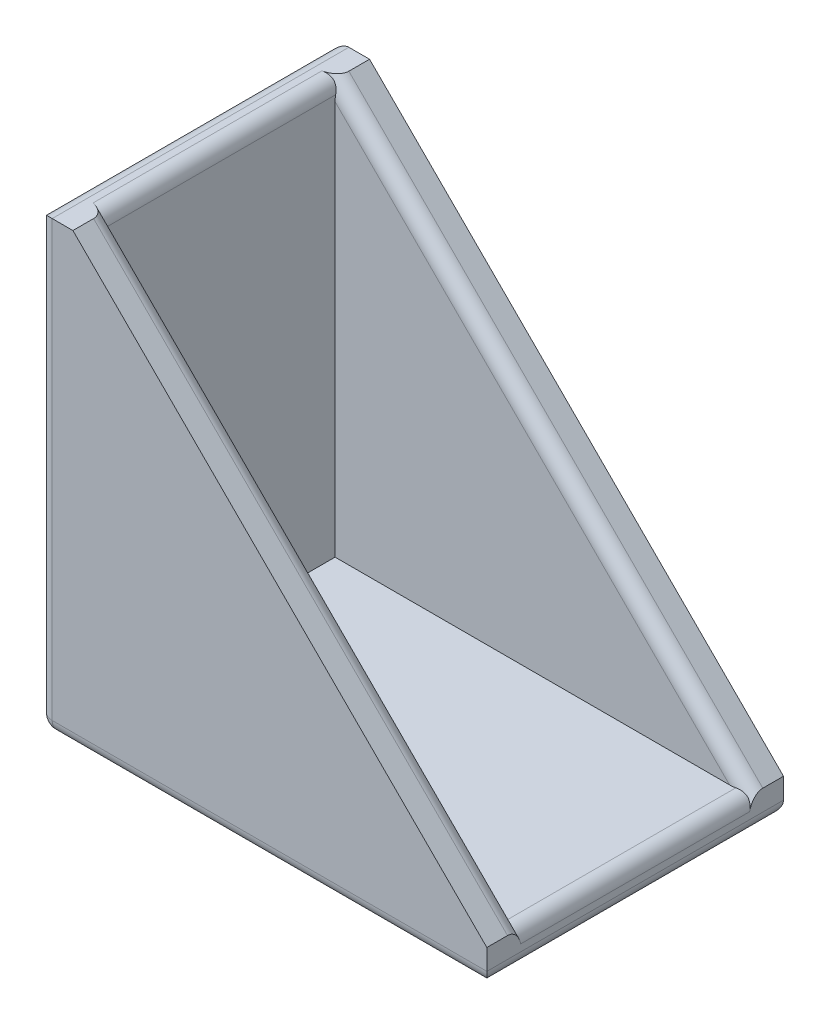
ISO-10303-21;
HEADER;
FILE_DESCRIPTION(('STEP AP214'),'2;1');
FILE_NAME('part.step','',(''),(''),'','','');
FILE_SCHEMA(('AUTOMOTIVE_DESIGN { 1 0 10303 214 1 1 1 1 }'));
ENDSEC;
DATA;
#1=APPLICATION_CONTEXT('core data for automotive mechanical design processes');
#2=APPLICATION_PROTOCOL_DEFINITION('international standard','automotive_design',2000,#1);
#3=PRODUCT_CONTEXT('',#1,'mechanical');
#4=PRODUCT('Part','Part','',(#3));
#5=PRODUCT_RELATED_PRODUCT_CATEGORY('part','',(#4));
#6=PRODUCT_DEFINITION_FORMATION('','',#4);
#7=PRODUCT_DEFINITION_CONTEXT('part definition',#1,'design');
#8=PRODUCT_DEFINITION('design','',#6,#7);
#9=PRODUCT_DEFINITION_SHAPE('','',#8);
#10=(LENGTH_UNIT() NAMED_UNIT(*) SI_UNIT(.MILLI.,.METRE.));
#11=(NAMED_UNIT(*) PLANE_ANGLE_UNIT() SI_UNIT($,.RADIAN.));
#12=(NAMED_UNIT(*) SI_UNIT($,.STERADIAN.) SOLID_ANGLE_UNIT());
#13=UNCERTAINTY_MEASURE_WITH_UNIT(LENGTH_MEASURE(1.E-05),#10,'distance_accuracy_value','');
#14=(GEOMETRIC_REPRESENTATION_CONTEXT(3) GLOBAL_UNCERTAINTY_ASSIGNED_CONTEXT((#13)) GLOBAL_UNIT_ASSIGNED_CONTEXT((#10,
#11,#12)) REPRESENTATION_CONTEXT('',''));
#15=CARTESIAN_POINT('',(0.,0.,0.));
#16=DIRECTION('',(0.,0.,1.));
#17=DIRECTION('',(1.,0.,0.));
#18=AXIS2_PLACEMENT_3D('',#15,#16,#17);
#19=CARTESIAN_POINT('',(15.,17.5,0.));
#20=DIRECTION('',(-1.,0.,0.));
#21=DIRECTION('',(0.,0.,1.));
#22=AXIS2_PLACEMENT_3D('',#19,#20,#21);
#23=PLANE('',#22);
#24=CARTESIAN_POINT('',(15.,-16.4142135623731,-9.25));
#25=DIRECTION('',(-1.,0.,0.));
#26=DIRECTION('',(0.,1.,0.));
#27=AXIS2_PLACEMENT_3D('',#24,#25,#26);
#28=ELLIPSE('',#27,1.41421356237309,1.);
#29=CARTESIAN_POINT('',(15.,-15.,-9.25));
#30=VERTEX_POINT('',#29);
#31=CARTESIAN_POINT('',(15.,-16.,-8.29385484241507));
#32=VERTEX_POINT('',#31);
#33=EDGE_CURVE('E322',#30,#32,#28,.F.);
#34=ORIENTED_EDGE('',*,*,#33,.T.);
#35=DIRECTION('',(0.,0.,1.));
#36=VECTOR('',#35,1.);
#37=CARTESIAN_POINT('',(15.,-16.,8.25));
#38=LINE('',#37,#36);
#39=CARTESIAN_POINT('',(15.,-16.,8.29385484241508));
#40=VERTEX_POINT('',#39);
#41=EDGE_CURVE('E258',#32,#40,#38,.T.);
#42=ORIENTED_EDGE('',*,*,#41,.T.);
#43=CARTESIAN_POINT('',(15.,-16.4142135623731,9.25));
#44=DIRECTION('',(-1.,0.,0.));
#45=DIRECTION('',(0.,-1.,0.));
#46=AXIS2_PLACEMENT_3D('',#43,#44,#45);
#47=ELLIPSE('',#46,1.41421356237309,1.);
#48=CARTESIAN_POINT('',(15.,-15.,9.25));
#49=VERTEX_POINT('',#48);
#50=EDGE_CURVE('E319',#40,#49,#47,.F.);
#51=ORIENTED_EDGE('',*,*,#50,.T.);
#52=DIRECTION('',(0.,0.,1.));
#53=VECTOR('',#52,1.);
#54=CARTESIAN_POINT('',(15.,-15.,-10.75));
#55=LINE('',#54,#53);
#56=CARTESIAN_POINT('',(15.,-15.,10.75));
#57=VERTEX_POINT('',#56);
#58=EDGE_CURVE('E186',#49,#57,#55,.T.);
#59=ORIENTED_EDGE('',*,*,#58,.T.);
#60=DIRECTION('',(0.,-1.,0.));
#61=VECTOR('',#60,1.);
#62=CARTESIAN_POINT('',(15.,17.5,10.75));
#63=LINE('',#62,#61);
#64=CARTESIAN_POINT('',(15.,-16.5,10.75));
#65=VERTEX_POINT('',#64);
#66=EDGE_CURVE('E203',#57,#65,#63,.T.);
#67=ORIENTED_EDGE('',*,*,#66,.T.);
#68=DIRECTION('',(0.,0.,-1.));
#69=VECTOR('',#68,1.);
#70=CARTESIAN_POINT('',(15.,-16.5,0.));
#71=LINE('',#70,#69);
#72=CARTESIAN_POINT('',(15.,-16.5,-10.75));
#73=VERTEX_POINT('',#72);
#74=EDGE_CURVE('E201',#65,#73,#71,.T.);
#75=ORIENTED_EDGE('',*,*,#74,.T.);
#76=DIRECTION('',(0.,-1.,0.));
#77=VECTOR('',#76,1.);
#78=CARTESIAN_POINT('',(15.,17.5,-10.75));
#79=LINE('',#78,#77);
#80=CARTESIAN_POINT('',(15.,-15.,-10.75));
#81=VERTEX_POINT('',#80);
#82=EDGE_CURVE('E192',#81,#73,#79,.T.);
#83=ORIENTED_EDGE('',*,*,#82,.F.);
#84=EDGE_CURVE('E172',#81,#30,#55,.T.);
#85=ORIENTED_EDGE('',*,*,#84,.T.);
#86=EDGE_LOOP('',(#34,#42,#51,#59,#67,#75,#83,#85));
#87=FACE_BOUND('',#86,.T.);
#88=ADVANCED_FACE('F41',(#87),#23,.F.);
#89=CARTESIAN_POINT('',(0.,17.5,10.75));
#90=DIRECTION('',(0.,0.,-1.));
#91=DIRECTION('',(-1.,0.,0.));
#92=AXIS2_PLACEMENT_3D('',#89,#90,#91);
#93=PLANE('',#92);
#94=DIRECTION('',(0.,-1.,0.));
#95=VECTOR('',#94,1.);
#96=CARTESIAN_POINT('',(-16.5,17.5,10.75));
#97=LINE('',#96,#95);
#98=CARTESIAN_POINT('',(-16.5,15.,10.75));
#99=VERTEX_POINT('',#98);
#100=CARTESIAN_POINT('',(-16.5,-16.5,10.75));
#101=VERTEX_POINT('',#100);
#102=EDGE_CURVE('E252',#99,#101,#97,.T.);
#103=ORIENTED_EDGE('',*,*,#102,.T.);
#104=DIRECTION('',(1.,0.,0.));
#105=VECTOR('',#104,1.);
#106=CARTESIAN_POINT('',(0.,-16.5,10.75));
#107=LINE('',#106,#105);
#108=EDGE_CURVE('E255',#101,#65,#107,.T.);
#109=ORIENTED_EDGE('',*,*,#108,.T.);
#110=ORIENTED_EDGE('',*,*,#66,.F.);
#111=DIRECTION('',(-0.707106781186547,0.707106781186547,0.));
#112=VECTOR('',#111,1.);
#113=CARTESIAN_POINT('',(15.,-15.,10.75));
#114=LINE('',#113,#112);
#115=CARTESIAN_POINT('',(-15.,15.,10.75));
#116=VERTEX_POINT('',#115);
#117=EDGE_CURVE('E296',#57,#116,#114,.T.);
#118=ORIENTED_EDGE('',*,*,#117,.T.);
#119=DIRECTION('',(-1.,0.,0.));
#120=VECTOR('',#119,1.);
#121=CARTESIAN_POINT('',(-15.,15.,10.75));
#122=LINE('',#121,#120);
#123=EDGE_CURVE('E197',#116,#99,#122,.T.);
#124=ORIENTED_EDGE('',*,*,#123,.T.);
#125=EDGE_LOOP('',(#103,#109,#110,#118,#124));
#126=FACE_BOUND('',#125,.T.);
#127=ADVANCED_FACE('F432',(#126),#93,.F.);
#128=CARTESIAN_POINT('',(0.,17.5,-10.75));
#129=DIRECTION('',(0.,0.,-1.));
#130=DIRECTION('',(-1.,0.,0.));
#131=AXIS2_PLACEMENT_3D('',#128,#129,#130);
#132=PLANE('',#131);
#133=ORIENTED_EDGE('',*,*,#82,.T.);
#134=DIRECTION('',(1.,0.,0.));
#135=VECTOR('',#134,1.);
#136=CARTESIAN_POINT('',(-17.5,-16.5,-10.75));
#137=LINE('',#136,#135);
#138=CARTESIAN_POINT('',(-16.5,-16.5,-10.75));
#139=VERTEX_POINT('',#138);
#140=EDGE_CURVE('E247',#73,#139,#137,.F.);
#141=ORIENTED_EDGE('',*,*,#140,.T.);
#142=DIRECTION('',(0.,-1.,0.));
#143=VECTOR('',#142,1.);
#144=CARTESIAN_POINT('',(-16.5,15.,-10.75));
#145=LINE('',#144,#143);
#146=CARTESIAN_POINT('',(-16.5,15.,-10.75));
#147=VERTEX_POINT('',#146);
#148=EDGE_CURVE('E244',#139,#147,#145,.F.);
#149=ORIENTED_EDGE('',*,*,#148,.T.);
#150=DIRECTION('',(-1.,0.,0.));
#151=VECTOR('',#150,1.);
#152=CARTESIAN_POINT('',(-15.,15.,-10.75));
#153=LINE('',#152,#151);
#154=CARTESIAN_POINT('',(-15.,15.,-10.75));
#155=VERTEX_POINT('',#154);
#156=EDGE_CURVE('E195',#155,#147,#153,.T.);
#157=ORIENTED_EDGE('',*,*,#156,.F.);
#158=DIRECTION('',(-0.707106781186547,0.707106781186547,0.));
#159=VECTOR('',#158,1.);
#160=CARTESIAN_POINT('',(15.,-15.,-10.75));
#161=LINE('',#160,#159);
#162=EDGE_CURVE('E176',#81,#155,#161,.T.);
#163=ORIENTED_EDGE('',*,*,#162,.F.);
#164=EDGE_LOOP('',(#133,#141,#149,#157,#163));
#165=FACE_BOUND('',#164,.T.);
#166=ADVANCED_FACE('F191',(#165),#132,.T.);
#167=CARTESIAN_POINT('',(-17.5,17.5,0.));
#168=DIRECTION('',(1.,0.,0.));
#169=DIRECTION('',(0.,0.,-1.));
#170=AXIS2_PLACEMENT_3D('',#167,#168,#169);
#171=PLANE('',#170);
#172=DIRECTION('',(0.,0.,1.));
#173=VECTOR('',#172,1.);
#174=CARTESIAN_POINT('',(-17.5,14.,-10.75));
#175=LINE('',#174,#173);
#176=CARTESIAN_POINT('',(-17.5,14.,9.75));
#177=VERTEX_POINT('',#176);
#178=CARTESIAN_POINT('',(-17.5,14.,-9.75));
#179=VERTEX_POINT('',#178);
#180=EDGE_CURVE('E224',#177,#179,#175,.F.);
#181=ORIENTED_EDGE('',*,*,#180,.T.);
#182=DIRECTION('',(0.,-1.,0.));
#183=VECTOR('',#182,1.);
#184=CARTESIAN_POINT('',(-17.5,-17.5,-9.75));
#185=LINE('',#184,#183);
#186=CARTESIAN_POINT('',(-17.5,-16.5,-9.75));
#187=VERTEX_POINT('',#186);
#188=EDGE_CURVE('E228',#179,#187,#185,.T.);
#189=ORIENTED_EDGE('',*,*,#188,.T.);
#190=DIRECTION('',(0.,0.,1.));
#191=VECTOR('',#190,1.);
#192=CARTESIAN_POINT('',(-17.5,-16.5,0.));
#193=LINE('',#192,#191);
#194=CARTESIAN_POINT('',(-17.5,-16.5,9.75));
#195=VERTEX_POINT('',#194);
#196=EDGE_CURVE('E221',#187,#195,#193,.T.);
#197=ORIENTED_EDGE('',*,*,#196,.T.);
#198=DIRECTION('',(0.,-1.,0.));
#199=VECTOR('',#198,1.);
#200=CARTESIAN_POINT('',(-17.5,17.5,9.75));
#201=LINE('',#200,#199);
#202=EDGE_CURVE('E218',#195,#177,#201,.F.);
#203=ORIENTED_EDGE('',*,*,#202,.T.);
#204=EDGE_LOOP('',(#181,#189,#197,#203));
#205=FACE_BOUND('',#204,.T.);
#206=ADVANCED_FACE('F610',(#205),#171,.F.);
#207=CARTESIAN_POINT('',(0.,-15.,8.25));
#208=DIRECTION('',(0.,0.,1.));
#209=DIRECTION('',(1.,0.,0.));
#210=AXIS2_PLACEMENT_3D('',#207,#208,#209);
#211=PLANE('',#210);
#212=DIRECTION('',(0.,1.,0.));
#213=VECTOR('',#212,1.);
#214=CARTESIAN_POINT('',(-15.,-15.,8.25));
#215=LINE('',#214,#213);
#216=CARTESIAN_POINT('',(-15.,-15.,8.25));
#217=VERTEX_POINT('',#216);
#218=CARTESIAN_POINT('',(-15.,13.5857864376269,8.25));
#219=VERTEX_POINT('',#218);
#220=EDGE_CURVE('E204',#217,#219,#215,.T.);
#221=ORIENTED_EDGE('',*,*,#220,.T.);
#222=DIRECTION('',(-0.707106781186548,0.707106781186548,0.));
#223=VECTOR('',#222,1.);
#224=CARTESIAN_POINT('',(14.2928932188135,-15.7071067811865,8.25));
#225=LINE('',#224,#223);
#226=CARTESIAN_POINT('',(13.5857864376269,-15.,8.25));
#227=VERTEX_POINT('',#226);
#228=EDGE_CURVE('E329',#219,#227,#225,.F.);
#229=ORIENTED_EDGE('',*,*,#228,.T.);
#230=DIRECTION('',(1.,0.,0.));
#231=VECTOR('',#230,1.);
#232=CARTESIAN_POINT('',(0.,-15.,8.25));
#233=LINE('',#232,#231);
#234=EDGE_CURVE('E379',#217,#227,#233,.T.);
#235=ORIENTED_EDGE('',*,*,#234,.F.);
#236=EDGE_LOOP('',(#221,#229,#235));
#237=FACE_BOUND('',#236,.T.);
#238=ADVANCED_FACE('F605',(#237),#211,.F.);
#239=CARTESIAN_POINT('',(0.,-15.,-8.25));
#240=DIRECTION('',(0.,0.,1.));
#241=DIRECTION('',(1.,0.,0.));
#242=AXIS2_PLACEMENT_3D('',#239,#240,#241);
#243=PLANE('',#242);
#244=DIRECTION('',(1.,0.,0.));
#245=VECTOR('',#244,1.);
#246=CARTESIAN_POINT('',(0.,-15.,-8.25));
#247=LINE('',#246,#245);
#248=CARTESIAN_POINT('',(-15.,-15.,-8.25));
#249=VERTEX_POINT('',#248);
#250=CARTESIAN_POINT('',(13.5857864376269,-15.,-8.25));
#251=VERTEX_POINT('',#250);
#252=EDGE_CURVE('E185',#249,#251,#247,.T.);
#253=ORIENTED_EDGE('',*,*,#252,.T.);
#254=DIRECTION('',(-0.707106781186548,0.707106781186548,0.));
#255=VECTOR('',#254,1.);
#256=CARTESIAN_POINT('',(6.79289321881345,-8.20710678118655,-8.25));
#257=LINE('',#256,#255);
#258=CARTESIAN_POINT('',(-15.,13.5857864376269,-8.25));
#259=VERTEX_POINT('',#258);
#260=EDGE_CURVE('E306',#251,#259,#257,.T.);
#261=ORIENTED_EDGE('',*,*,#260,.T.);
#262=DIRECTION('',(0.,1.,0.));
#263=VECTOR('',#262,1.);
#264=CARTESIAN_POINT('',(-15.,-15.,-8.25));
#265=LINE('',#264,#263);
#266=EDGE_CURVE('E211',#249,#259,#265,.T.);
#267=ORIENTED_EDGE('',*,*,#266,.F.);
#268=EDGE_LOOP('',(#253,#261,#267));
#269=FACE_BOUND('',#268,.T.);
#270=ADVANCED_FACE('F394',(#269),#243,.T.);
#271=CARTESIAN_POINT('',(0.,-17.5,0.));
#272=DIRECTION('',(0.,1.,0.));
#273=DIRECTION('',(0.,0.,1.));
#274=AXIS2_PLACEMENT_3D('',#271,#272,#273);
#275=PLANE('',#274);
#276=DIRECTION('',(0.,0.,1.));
#277=VECTOR('',#276,1.);
#278=CARTESIAN_POINT('',(-16.5,-17.5,0.));
#279=LINE('',#278,#277);
#280=CARTESIAN_POINT('',(-16.5,-17.5,9.75));
#281=VERTEX_POINT('',#280);
#282=CARTESIAN_POINT('',(-16.5,-17.5,-9.75));
#283=VERTEX_POINT('',#282);
#284=EDGE_CURVE('E231',#281,#283,#279,.F.);
#285=ORIENTED_EDGE('',*,*,#284,.T.);
#286=DIRECTION('',(1.,0.,0.));
#287=VECTOR('',#286,1.);
#288=CARTESIAN_POINT('',(15.,-17.5,-9.75));
#289=LINE('',#288,#287);
#290=CARTESIAN_POINT('',(14.,-17.5,-9.75));
#291=VERTEX_POINT('',#290);
#292=EDGE_CURVE('E240',#283,#291,#289,.T.);
#293=ORIENTED_EDGE('',*,*,#292,.T.);
#294=DIRECTION('',(0.,0.,-1.));
#295=VECTOR('',#294,1.);
#296=CARTESIAN_POINT('',(14.,-17.5,0.));
#297=LINE('',#296,#295);
#298=CARTESIAN_POINT('',(14.,-17.5,9.75));
#299=VERTEX_POINT('',#298);
#300=EDGE_CURVE('E237',#291,#299,#297,.F.);
#301=ORIENTED_EDGE('',*,*,#300,.T.);
#302=DIRECTION('',(1.,0.,0.));
#303=VECTOR('',#302,1.);
#304=CARTESIAN_POINT('',(0.,-17.5,9.75));
#305=LINE('',#304,#303);
#306=EDGE_CURVE('E234',#299,#281,#305,.F.);
#307=ORIENTED_EDGE('',*,*,#306,.T.);
#308=EDGE_LOOP('',(#285,#293,#301,#307));
#309=FACE_BOUND('',#308,.T.);
#310=ADVANCED_FACE('F445',(#309),#275,.F.);
#311=CARTESIAN_POINT('',(-15.,-15.,0.));
#312=DIRECTION('',(-1.,0.,0.));
#313=DIRECTION('',(0.,0.,1.));
#314=AXIS2_PLACEMENT_3D('',#311,#312,#313);
#315=PLANE('',#314);
#316=ORIENTED_EDGE('',*,*,#266,.T.);
#317=CARTESIAN_POINT('',(-15.,13.5857864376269,-9.25));
#318=DIRECTION('',(-1.,0.,0.));
#319=DIRECTION('',(0.,1.,0.));
#320=AXIS2_PLACEMENT_3D('',#317,#318,#319);
#321=ELLIPSE('',#320,1.41421356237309,1.);
#322=CARTESIAN_POINT('',(-15.,14.,-8.29385484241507));
#323=VERTEX_POINT('',#322);
#324=EDGE_CURVE('E332',#259,#323,#321,.T.);
#325=ORIENTED_EDGE('',*,*,#324,.T.);
#326=DIRECTION('',(0.,0.,1.));
#327=VECTOR('',#326,1.);
#328=CARTESIAN_POINT('',(-15.,14.,8.25));
#329=LINE('',#328,#327);
#330=CARTESIAN_POINT('',(-15.,14.,8.29385484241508));
#331=VERTEX_POINT('',#330);
#332=EDGE_CURVE('E70',#323,#331,#329,.T.);
#333=ORIENTED_EDGE('',*,*,#332,.T.);
#334=CARTESIAN_POINT('',(-15.,13.5857864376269,9.25));
#335=DIRECTION('',(-1.,0.,0.));
#336=DIRECTION('',(0.,-1.,0.));
#337=AXIS2_PLACEMENT_3D('',#334,#335,#336);
#338=ELLIPSE('',#337,1.41421356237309,1.);
#339=EDGE_CURVE('E368',#331,#219,#338,.T.);
#340=ORIENTED_EDGE('',*,*,#339,.T.);
#341=ORIENTED_EDGE('',*,*,#220,.F.);
#342=DIRECTION('',(0.,0.,1.));
#343=VECTOR('',#342,1.);
#344=CARTESIAN_POINT('',(-15.,-15.,0.));
#345=LINE('',#344,#343);
#346=EDGE_CURVE('E397',#249,#217,#345,.T.);
#347=ORIENTED_EDGE('',*,*,#346,.F.);
#348=EDGE_LOOP('',(#316,#325,#333,#340,#341,#347));
#349=FACE_BOUND('',#348,.T.);
#350=ADVANCED_FACE('F401',(#349),#315,.F.);
#351=CARTESIAN_POINT('',(0.,-15.,0.));
#352=DIRECTION('',(0.,1.,0.));
#353=DIRECTION('',(0.,0.,1.));
#354=AXIS2_PLACEMENT_3D('',#351,#352,#353);
#355=PLANE('',#354);
#356=ORIENTED_EDGE('',*,*,#234,.T.);
#357=CARTESIAN_POINT('',(13.5857864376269,-15.,9.25));
#358=DIRECTION('',(0.,1.,0.));
#359=DIRECTION('',(1.,0.,0.));
#360=AXIS2_PLACEMENT_3D('',#357,#358,#359);
#361=ELLIPSE('',#360,1.41421356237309,1.);
#362=CARTESIAN_POINT('',(14.,-15.,8.29385484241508));
#363=VERTEX_POINT('',#362);
#364=EDGE_CURVE('E56',#227,#363,#361,.F.);
#365=ORIENTED_EDGE('',*,*,#364,.T.);
#366=DIRECTION('',(0.,0.,1.));
#367=VECTOR('',#366,1.);
#368=CARTESIAN_POINT('',(14.,-15.,-8.25));
#369=LINE('',#368,#367);
#370=CARTESIAN_POINT('',(14.,-15.,-8.29385484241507));
#371=VERTEX_POINT('',#370);
#372=EDGE_CURVE('E62',#363,#371,#369,.F.);
#373=ORIENTED_EDGE('',*,*,#372,.T.);
#374=CARTESIAN_POINT('',(13.5857864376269,-15.,-9.25));
#375=DIRECTION('',(0.,1.,0.));
#376=DIRECTION('',(-1.,0.,0.));
#377=AXIS2_PLACEMENT_3D('',#374,#375,#376);
#378=ELLIPSE('',#377,1.41421356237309,1.);
#379=EDGE_CURVE('E369',#371,#251,#378,.F.);
#380=ORIENTED_EDGE('',*,*,#379,.T.);
#381=ORIENTED_EDGE('',*,*,#252,.F.);
#382=ORIENTED_EDGE('',*,*,#346,.T.);
#383=EDGE_LOOP('',(#356,#365,#373,#380,#381,#382));
#384=FACE_BOUND('',#383,.T.);
#385=ADVANCED_FACE('F376',(#384),#355,.T.);
#386=CARTESIAN_POINT('',(15.,-15.,-10.75));
#387=DIRECTION('',(0.707106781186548,0.707106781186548,0.));
#388=DIRECTION('',(-0.707106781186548,0.707106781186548,0.));
#389=AXIS2_PLACEMENT_3D('',#386,#387,#388);
#390=PLANE('',#389);
#391=ORIENTED_EDGE('',*,*,#58,.F.);
#392=DIRECTION('',(-0.707106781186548,0.707106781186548,0.));
#393=VECTOR('',#392,1.);
#394=CARTESIAN_POINT('',(-15.,15.,9.25));
#395=LINE('',#394,#393);
#396=CARTESIAN_POINT('',(-15.,15.,9.25));
#397=VERTEX_POINT('',#396);
#398=EDGE_CURVE('E325',#49,#397,#395,.T.);
#399=ORIENTED_EDGE('',*,*,#398,.T.);
#400=DIRECTION('',(0.,0.,1.));
#401=VECTOR('',#400,1.);
#402=CARTESIAN_POINT('',(-15.,15.,-10.75));
#403=LINE('',#402,#401);
#404=EDGE_CURVE('E411',#397,#116,#403,.T.);
#405=ORIENTED_EDGE('',*,*,#404,.T.);
#406=ORIENTED_EDGE('',*,*,#117,.F.);
#407=EDGE_LOOP('',(#391,#399,#405,#406));
#408=FACE_BOUND('',#407,.T.);
#409=ADVANCED_FACE('F427',(#408),#390,.T.);
#410=CARTESIAN_POINT('',(-15.,15.,-9.25));
#411=VERTEX_POINT('',#410);
#412=EDGE_CURVE('E408',#155,#411,#403,.T.);
#413=ORIENTED_EDGE('',*,*,#412,.T.);
#414=DIRECTION('',(-0.707106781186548,0.707106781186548,0.));
#415=VECTOR('',#414,1.);
#416=CARTESIAN_POINT('',(15.,-15.,-9.25));
#417=LINE('',#416,#415);
#418=EDGE_CURVE('E179',#411,#30,#417,.F.);
#419=ORIENTED_EDGE('',*,*,#418,.T.);
#420=ORIENTED_EDGE('',*,*,#84,.F.);
#421=ORIENTED_EDGE('',*,*,#162,.T.);
#422=EDGE_LOOP('',(#413,#419,#420,#421));
#423=FACE_BOUND('',#422,.T.);
#424=ADVANCED_FACE('F175',(#423),#390,.T.);
#425=CARTESIAN_POINT('',(-15.,15.,-10.75));
#426=DIRECTION('',(0.,1.,0.));
#427=DIRECTION('',(-1.,0.,0.));
#428=AXIS2_PLACEMENT_3D('',#425,#426,#427);
#429=PLANE('',#428);
#430=DIRECTION('',(0.,0.,1.));
#431=VECTOR('',#430,1.);
#432=CARTESIAN_POINT('',(-16.,15.,-8.25));
#433=LINE('',#432,#431);
#434=CARTESIAN_POINT('',(-16.,15.,8.29385484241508));
#435=VERTEX_POINT('',#434);
#436=CARTESIAN_POINT('',(-16.,15.,-8.29385484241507));
#437=VERTEX_POINT('',#436);
#438=EDGE_CURVE('E303',#435,#437,#433,.F.);
#439=ORIENTED_EDGE('',*,*,#438,.T.);
#440=CARTESIAN_POINT('',(-16.4142135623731,15.,-9.25));
#441=DIRECTION('',(0.,1.,0.));
#442=DIRECTION('',(-1.,0.,0.));
#443=AXIS2_PLACEMENT_3D('',#440,#441,#442);
#444=ELLIPSE('',#443,1.4142135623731,1.);
#445=EDGE_CURVE('E314',#437,#411,#444,.T.);
#446=ORIENTED_EDGE('',*,*,#445,.T.);
#447=ORIENTED_EDGE('',*,*,#412,.F.);
#448=ORIENTED_EDGE('',*,*,#156,.T.);
#449=DIRECTION('',(0.,0.,1.));
#450=VECTOR('',#449,1.);
#451=CARTESIAN_POINT('',(-16.5,15.,10.75));
#452=LINE('',#451,#450);
#453=EDGE_CURVE('E208',#147,#99,#452,.T.);
#454=ORIENTED_EDGE('',*,*,#453,.T.);
#455=ORIENTED_EDGE('',*,*,#123,.F.);
#456=ORIENTED_EDGE('',*,*,#404,.F.);
#457=CARTESIAN_POINT('',(-16.4142135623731,15.,9.25));
#458=DIRECTION('',(0.,1.,0.));
#459=DIRECTION('',(1.,0.,0.));
#460=AXIS2_PLACEMENT_3D('',#457,#458,#459);
#461=ELLIPSE('',#460,1.4142135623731,1.);
#462=EDGE_CURVE('E310',#397,#435,#461,.T.);
#463=ORIENTED_EDGE('',*,*,#462,.T.);
#464=EDGE_LOOP('',(#439,#446,#447,#448,#454,#455,#456,#463));
#465=FACE_BOUND('',#464,.T.);
#466=ADVANCED_FACE('F429',(#465),#429,.T.);
#467=CARTESIAN_POINT('',(14.,-16.5,0.));
#468=DIRECTION('',(0.,0.,-1.));
#469=DIRECTION('',(-1.,0.,0.));
#470=AXIS2_PLACEMENT_3D('',#467,#468,#469);
#471=CYLINDRICAL_SURFACE('',#470,1.);
#472=CARTESIAN_POINT('',(14.,-16.5,9.75));
#473=DIRECTION('',(0.707106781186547,0.,-0.707106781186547));
#474=DIRECTION('',(0.707106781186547,0.,0.707106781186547));
#475=AXIS2_PLACEMENT_3D('',#472,#473,#474);
#476=ELLIPSE('',#475,1.41421356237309,1.);
#477=EDGE_CURVE('E289',#299,#65,#476,.F.);
#478=ORIENTED_EDGE('',*,*,#477,.F.);
#479=ORIENTED_EDGE('',*,*,#300,.F.);
#480=CARTESIAN_POINT('',(14.,-16.5,-9.75));
#481=DIRECTION('',(-0.707106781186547,0.,-0.707106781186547));
#482=DIRECTION('',(0.707106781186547,0.,-0.707106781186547));
#483=AXIS2_PLACEMENT_3D('',#480,#481,#482);
#484=ELLIPSE('',#483,1.41421356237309,1.);
#485=EDGE_CURVE('E293',#73,#291,#484,.T.);
#486=ORIENTED_EDGE('',*,*,#485,.F.);
#487=ORIENTED_EDGE('',*,*,#74,.F.);
#488=EDGE_LOOP('',(#478,#479,#486,#487));
#489=FACE_BOUND('',#488,.T.);
#490=ADVANCED_FACE('F436',(#489),#471,.T.);
#491=CARTESIAN_POINT('',(0.,-16.5,-9.75));
#492=DIRECTION('',(-1.,0.,0.));
#493=DIRECTION('',(0.,0.,1.));
#494=AXIS2_PLACEMENT_3D('',#491,#492,#493);
#495=CYLINDRICAL_SURFACE('',#494,1.);
#496=ORIENTED_EDGE('',*,*,#485,.T.);
#497=ORIENTED_EDGE('',*,*,#292,.F.);
#498=CARTESIAN_POINT('',(-16.5,-16.5,-9.75));
#499=DIRECTION('',(-1.,0.,0.));
#500=DIRECTION('',(0.,-1.,0.));
#501=AXIS2_PLACEMENT_3D('',#498,#499,#500);
#502=CIRCLE('',#501,1.);
#503=EDGE_CURVE('E281',#139,#283,#502,.T.);
#504=ORIENTED_EDGE('',*,*,#503,.F.);
#505=ORIENTED_EDGE('',*,*,#140,.F.);
#506=EDGE_LOOP('',(#496,#497,#504,#505));
#507=FACE_BOUND('',#506,.T.);
#508=ADVANCED_FACE('F459',(#507),#495,.T.);
#509=CARTESIAN_POINT('',(0.,-16.5,9.75));
#510=DIRECTION('',(1.,0.,0.));
#511=DIRECTION('',(0.,0.,-1.));
#512=AXIS2_PLACEMENT_3D('',#509,#510,#511);
#513=CYLINDRICAL_SURFACE('',#512,1.);
#514=ORIENTED_EDGE('',*,*,#477,.T.);
#515=ORIENTED_EDGE('',*,*,#108,.F.);
#516=CARTESIAN_POINT('',(-16.5,-16.5,9.75));
#517=DIRECTION('',(-1.,0.,0.));
#518=DIRECTION('',(0.,0.,1.));
#519=AXIS2_PLACEMENT_3D('',#516,#517,#518);
#520=CIRCLE('',#519,1.);
#521=EDGE_CURVE('E277',#281,#101,#520,.T.);
#522=ORIENTED_EDGE('',*,*,#521,.F.);
#523=ORIENTED_EDGE('',*,*,#306,.F.);
#524=EDGE_LOOP('',(#514,#515,#522,#523));
#525=FACE_BOUND('',#524,.T.);
#526=ADVANCED_FACE('F441',(#525),#513,.T.);
#527=CARTESIAN_POINT('',(-16.5,-16.5,0.));
#528=DIRECTION('',(0.,0.,1.));
#529=DIRECTION('',(1.,0.,0.));
#530=AXIS2_PLACEMENT_3D('',#527,#528,#529);
#531=CYLINDRICAL_SURFACE('',#530,1.);
#532=CARTESIAN_POINT('',(-16.5,-16.5,-9.75));
#533=DIRECTION('',(0.,0.,-1.));
#534=DIRECTION('',(-1.,0.,0.));
#535=AXIS2_PLACEMENT_3D('',#532,#533,#534);
#536=CIRCLE('',#535,1.);
#537=EDGE_CURVE('E285',#283,#187,#536,.T.);
#538=ORIENTED_EDGE('',*,*,#537,.F.);
#539=ORIENTED_EDGE('',*,*,#284,.F.);
#540=CARTESIAN_POINT('',(-16.5,-16.5,9.75));
#541=DIRECTION('',(0.,0.,1.));
#542=DIRECTION('',(1.,0.,0.));
#543=AXIS2_PLACEMENT_3D('',#540,#541,#542);
#544=CIRCLE('',#543,1.);
#545=EDGE_CURVE('E273',#195,#281,#544,.T.);
#546=ORIENTED_EDGE('',*,*,#545,.F.);
#547=ORIENTED_EDGE('',*,*,#196,.F.);
#548=EDGE_LOOP('',(#538,#539,#546,#547));
#549=FACE_BOUND('',#548,.T.);
#550=ADVANCED_FACE('F450',(#549),#531,.T.);
#551=CARTESIAN_POINT('',(-16.5,-16.5,-9.75));
#552=DIRECTION('',(0.,0.,1.));
#553=DIRECTION('',(1.,0.,0.));
#554=AXIS2_PLACEMENT_3D('',#551,#552,#553);
#555=SPHERICAL_SURFACE('',#554,1.);
#556=ORIENTED_EDGE('',*,*,#503,.T.);
#557=ORIENTED_EDGE('',*,*,#537,.T.);
#558=CARTESIAN_POINT('',(-16.5,-16.5,-9.75));
#559=DIRECTION('',(0.,-1.,0.));
#560=DIRECTION('',(0.,0.,-1.));
#561=AXIS2_PLACEMENT_3D('',#558,#559,#560);
#562=CIRCLE('',#561,1.);
#563=EDGE_CURVE('E269',#139,#187,#562,.F.);
#564=ORIENTED_EDGE('',*,*,#563,.F.);
#565=EDGE_LOOP('',(#556,#557,#564));
#566=FACE_BOUND('',#565,.T.);
#567=ADVANCED_FACE('F456',(#566),#555,.T.);
#568=CARTESIAN_POINT('',(-16.5,-16.5,9.75));
#569=DIRECTION('',(0.,0.,1.));
#570=DIRECTION('',(1.,0.,0.));
#571=AXIS2_PLACEMENT_3D('',#568,#569,#570);
#572=SPHERICAL_SURFACE('',#571,1.);
#573=ORIENTED_EDGE('',*,*,#545,.T.);
#574=ORIENTED_EDGE('',*,*,#521,.T.);
#575=CARTESIAN_POINT('',(-16.5,-16.5,9.75));
#576=DIRECTION('',(0.,-1.,0.));
#577=DIRECTION('',(0.,0.,-1.));
#578=AXIS2_PLACEMENT_3D('',#575,#576,#577);
#579=CIRCLE('',#578,1.);
#580=EDGE_CURVE('E265',#195,#101,#579,.F.);
#581=ORIENTED_EDGE('',*,*,#580,.F.);
#582=EDGE_LOOP('',(#573,#574,#581));
#583=FACE_BOUND('',#582,.T.);
#584=ADVANCED_FACE('F472',(#583),#572,.T.);
#585=CARTESIAN_POINT('',(-16.5,17.5,-9.75));
#586=DIRECTION('',(0.,1.,0.));
#587=DIRECTION('',(0.,0.,1.));
#588=AXIS2_PLACEMENT_3D('',#585,#586,#587);
#589=CYLINDRICAL_SURFACE('',#588,1.);
#590=ORIENTED_EDGE('',*,*,#563,.T.);
#591=ORIENTED_EDGE('',*,*,#188,.F.);
#592=CARTESIAN_POINT('',(-16.5,14.,-9.75));
#593=DIRECTION('',(0.,0.707106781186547,0.707106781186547));
#594=DIRECTION('',(0.,0.707106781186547,-0.707106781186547));
#595=AXIS2_PLACEMENT_3D('',#592,#593,#594);
#596=ELLIPSE('',#595,1.41421356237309,1.);
#597=EDGE_CURVE('E262',#147,#179,#596,.T.);
#598=ORIENTED_EDGE('',*,*,#597,.F.);
#599=ORIENTED_EDGE('',*,*,#148,.F.);
#600=EDGE_LOOP('',(#590,#591,#598,#599));
#601=FACE_BOUND('',#600,.T.);
#602=ADVANCED_FACE('F461',(#601),#589,.T.);
#603=CARTESIAN_POINT('',(-16.5,17.5,9.75));
#604=DIRECTION('',(0.,-1.,0.));
#605=DIRECTION('',(0.,0.,-1.));
#606=AXIS2_PLACEMENT_3D('',#603,#604,#605);
#607=CYLINDRICAL_SURFACE('',#606,1.);
#608=ORIENTED_EDGE('',*,*,#580,.T.);
#609=ORIENTED_EDGE('',*,*,#102,.F.);
#610=CARTESIAN_POINT('',(-16.5,14.,9.75));
#611=DIRECTION('',(0.,-0.707106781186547,0.707106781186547));
#612=DIRECTION('',(0.,-0.707106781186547,-0.707106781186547));
#613=AXIS2_PLACEMENT_3D('',#610,#611,#612);
#614=ELLIPSE('',#613,1.41421356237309,1.);
#615=EDGE_CURVE('E259',#177,#99,#614,.F.);
#616=ORIENTED_EDGE('',*,*,#615,.F.);
#617=ORIENTED_EDGE('',*,*,#202,.F.);
#618=EDGE_LOOP('',(#608,#609,#616,#617));
#619=FACE_BOUND('',#618,.T.);
#620=ADVANCED_FACE('F470',(#619),#607,.T.);
#621=CARTESIAN_POINT('',(-16.5,14.,-10.75));
#622=DIRECTION('',(0.,0.,-1.));
#623=DIRECTION('',(-1.,0.,0.));
#624=AXIS2_PLACEMENT_3D('',#621,#622,#623);
#625=CYLINDRICAL_SURFACE('',#624,1.);
#626=ORIENTED_EDGE('',*,*,#597,.T.);
#627=ORIENTED_EDGE('',*,*,#180,.F.);
#628=ORIENTED_EDGE('',*,*,#615,.T.);
#629=ORIENTED_EDGE('',*,*,#453,.F.);
#630=EDGE_LOOP('',(#626,#627,#628,#629));
#631=FACE_BOUND('',#630,.T.);
#632=ADVANCED_FACE('F465',(#631),#625,.T.);
#633=CARTESIAN_POINT('',(14.,-16.,0.));
#634=DIRECTION('',(0.,0.,-1.));
#635=DIRECTION('',(-1.,0.,0.));
#636=AXIS2_PLACEMENT_3D('',#633,#634,#635);
#637=CYLINDRICAL_SURFACE('',#636,1.);
#638=ORIENTED_EDGE('',*,*,#41,.F.);
#639=CARTESIAN_POINT('',(15.,-16.,-8.29385484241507));
#640=CARTESIAN_POINT('',(14.9999656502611,-15.9431840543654,-8.30613827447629));
#641=CARTESIAN_POINT('',(14.9951567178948,-15.8867944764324,-8.32009288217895));
#642=CARTESIAN_POINT('',(14.9760889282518,-15.7752836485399,-8.34880384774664));
#643=CARTESIAN_POINT('',(14.9617454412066,-15.720178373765,-8.36356628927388));
#644=CARTESIAN_POINT('',(14.9236821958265,-15.6126165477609,-8.39105785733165));
#645=CARTESIAN_POINT('',(14.8999466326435,-15.5601646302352,-8.40378350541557));
#646=CARTESIAN_POINT('',(14.8433541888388,-15.4595790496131,-8.42419008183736));
#647=CARTESIAN_POINT('',(14.8105432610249,-15.4114252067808,-8.43189578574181));
#648=CARTESIAN_POINT('',(14.7405377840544,-15.3259642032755,-8.43969295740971));
#649=CARTESIAN_POINT('',(14.7041691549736,-15.2880487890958,-8.4405010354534));
#650=CARTESIAN_POINT('',(14.6261095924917,-15.2185127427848,-8.43616611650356));
#651=CARTESIAN_POINT('',(14.5844136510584,-15.1868981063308,-8.43101748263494));
#652=CARTESIAN_POINT('',(14.5022533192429,-15.1340581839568,-8.41690311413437));
#653=CARTESIAN_POINT('',(14.4621889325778,-15.1120599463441,-8.40843854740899));
#654=CARTESIAN_POINT('',(14.3798968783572,-15.073858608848,-8.389213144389));
#655=CARTESIAN_POINT('',(14.3376675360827,-15.0576600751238,-8.37845050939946));
#656=CARTESIAN_POINT('',(14.2469917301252,-15.0296983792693,-8.35484948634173));
#657=CARTESIAN_POINT('',(14.1983654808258,-15.0186007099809,-8.34191237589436));
#658=CARTESIAN_POINT('',(14.0999322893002,-15.0037697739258,-8.31683787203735));
#659=CARTESIAN_POINT('',(14.0501284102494,-15.0000191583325,-8.30469866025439));
#660=CARTESIAN_POINT('',(14.,-15.,-8.29385484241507));
#661=B_SPLINE_CURVE_WITH_KNOTS('',3,(#639,#640,#641,#642,#643,#644,#645,#646,#647,#648,#649,
#650,#651,#652,#653,#654,#655,#656,#657,#658,#659,#660),.UNSPECIFIED.,.F.,.F.,(4,2,2,2,2,2,2,2,
2,2,4),(0.,0.174102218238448,0.349770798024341,0.525736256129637,0.700826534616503,
0.8574718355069,1.01426549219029,1.15321273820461,1.29226913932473,1.44630036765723,
1.59996743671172),.UNSPECIFIED.);
#662=EDGE_CURVE('E344',#32,#371,#661,.T.);
#663=ORIENTED_EDGE('',*,*,#662,.T.);
#664=ORIENTED_EDGE('',*,*,#372,.F.);
#665=CARTESIAN_POINT('',(14.,-15.,8.29385484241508));
#666=CARTESIAN_POINT('',(14.0568159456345,-15.0000343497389,8.3061382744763));
#667=CARTESIAN_POINT('',(14.1132055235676,-15.0048432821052,8.32009288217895));
#668=CARTESIAN_POINT('',(14.2247163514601,-15.0239110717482,8.34880384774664));
#669=CARTESIAN_POINT('',(14.279821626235,-15.0382545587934,8.36356628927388));
#670=CARTESIAN_POINT('',(14.3873834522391,-15.0763178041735,8.39105785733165));
#671=CARTESIAN_POINT('',(14.4398353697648,-15.1000533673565,8.40378350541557));
#672=CARTESIAN_POINT('',(14.5404209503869,-15.1566458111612,8.42419008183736));
#673=CARTESIAN_POINT('',(14.5885747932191,-15.1894567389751,8.43189578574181));
#674=CARTESIAN_POINT('',(14.6740357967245,-15.2594622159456,8.43969295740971));
#675=CARTESIAN_POINT('',(14.7119512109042,-15.2958308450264,8.4405010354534));
#676=CARTESIAN_POINT('',(14.7814872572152,-15.3738904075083,8.43616611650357));
#677=CARTESIAN_POINT('',(14.8131018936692,-15.4155863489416,8.43101748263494));
#678=CARTESIAN_POINT('',(14.8659418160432,-15.4977466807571,8.41690311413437));
#679=CARTESIAN_POINT('',(14.8879400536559,-15.5378110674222,8.408438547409));
#680=CARTESIAN_POINT('',(14.926141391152,-15.6201031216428,8.389213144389));
#681=CARTESIAN_POINT('',(14.9423399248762,-15.6623324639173,8.37845050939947));
#682=CARTESIAN_POINT('',(14.9703016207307,-15.7530082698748,8.35484948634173));
#683=CARTESIAN_POINT('',(14.9813992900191,-15.8016345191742,8.34191237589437));
#684=CARTESIAN_POINT('',(14.9962302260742,-15.9000677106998,8.31683787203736));
#685=CARTESIAN_POINT('',(14.9999808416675,-15.9498715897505,8.3046986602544));
#686=CARTESIAN_POINT('',(15.,-16.,8.29385484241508));
#687=B_SPLINE_CURVE_WITH_KNOTS('',3,(#665,#666,#667,#668,#669,#670,#671,#672,#673,#674,#675,
#676,#677,#678,#679,#680,#681,#682,#683,#684,#685,#686),.UNSPECIFIED.,.F.,.F.,(4,2,2,2,2,2,2,2,
2,2,4),(0.,0.174102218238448,0.349770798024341,0.525736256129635,0.700826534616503,
0.8574718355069,1.01426549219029,1.15321273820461,1.29226913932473,1.44630036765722,
1.59996743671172),.UNSPECIFIED.);
#688=EDGE_CURVE('E11',#363,#40,#687,.T.);
#689=ORIENTED_EDGE('',*,*,#688,.T.);
#690=EDGE_LOOP('',(#638,#663,#664,#689));
#691=FACE_BOUND('',#690,.T.);
#692=ADVANCED_FACE('F355',(#691),#637,.T.);
#693=CARTESIAN_POINT('',(-16.,14.,0.));
#694=DIRECTION('',(0.,0.,-1.));
#695=DIRECTION('',(-1.,0.,0.));
#696=AXIS2_PLACEMENT_3D('',#693,#694,#695);
#697=CYLINDRICAL_SURFACE('',#696,1.);
#698=ORIENTED_EDGE('',*,*,#332,.F.);
#699=CARTESIAN_POINT('',(-15.,14.,-8.29385484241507));
#700=CARTESIAN_POINT('',(-15.0000343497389,14.0568159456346,-8.30613827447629));
#701=CARTESIAN_POINT('',(-15.0048432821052,14.1132055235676,-8.32009288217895));
#702=CARTESIAN_POINT('',(-15.0239110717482,14.2247163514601,-8.34880384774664));
#703=CARTESIAN_POINT('',(-15.0382545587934,14.279821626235,-8.36356628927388));
#704=CARTESIAN_POINT('',(-15.0763178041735,14.3873834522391,-8.39105785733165));
#705=CARTESIAN_POINT('',(-15.1000533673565,14.4398353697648,-8.40378350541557));
#706=CARTESIAN_POINT('',(-15.1566458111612,14.5404209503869,-8.42419008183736));
#707=CARTESIAN_POINT('',(-15.1894567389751,14.5885747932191,-8.43189578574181));
#708=CARTESIAN_POINT('',(-15.2594622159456,14.6740357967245,-8.43969295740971));
#709=CARTESIAN_POINT('',(-15.2958308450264,14.7119512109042,-8.4405010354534));
#710=CARTESIAN_POINT('',(-15.3738904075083,14.7814872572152,-8.43616611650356));
#711=CARTESIAN_POINT('',(-15.4155863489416,14.8131018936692,-8.43101748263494));
#712=CARTESIAN_POINT('',(-15.4977466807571,14.8659418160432,-8.41690311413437));
#713=CARTESIAN_POINT('',(-15.5378110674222,14.8879400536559,-8.40843854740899));
#714=CARTESIAN_POINT('',(-15.6201031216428,14.926141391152,-8.389213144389));
#715=CARTESIAN_POINT('',(-15.6623324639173,14.9423399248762,-8.37845050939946));
#716=CARTESIAN_POINT('',(-15.7530082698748,14.9703016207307,-8.35484948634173));
#717=CARTESIAN_POINT('',(-15.8016345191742,14.9813992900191,-8.34191237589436));
#718=CARTESIAN_POINT('',(-15.9000677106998,14.9962302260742,-8.31683787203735));
#719=CARTESIAN_POINT('',(-15.9498715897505,14.9999808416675,-8.30469866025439));
#720=CARTESIAN_POINT('',(-16.,15.,-8.29385484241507));
#721=B_SPLINE_CURVE_WITH_KNOTS('',3,(#699,#700,#701,#702,#703,#704,#705,#706,#707,#708,#709,
#710,#711,#712,#713,#714,#715,#716,#717,#718,#719,#720),.UNSPECIFIED.,.F.,.F.,(4,2,2,2,2,2,2,2,
2,2,4),(0.,0.174102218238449,0.349770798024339,0.525736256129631,0.700826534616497,
0.857471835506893,1.01426549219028,1.1532127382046,1.29226913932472,1.44630036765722,
1.59996743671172),.UNSPECIFIED.);
#722=EDGE_CURVE('E335',#323,#437,#721,.T.);
#723=ORIENTED_EDGE('',*,*,#722,.T.);
#724=ORIENTED_EDGE('',*,*,#438,.F.);
#725=CARTESIAN_POINT('',(-16.,15.,8.29385484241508));
#726=CARTESIAN_POINT('',(-15.9431840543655,14.9999656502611,8.3061382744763));
#727=CARTESIAN_POINT('',(-15.8867944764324,14.9951567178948,8.32009288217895));
#728=CARTESIAN_POINT('',(-15.7752836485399,14.9760889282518,8.34880384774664));
#729=CARTESIAN_POINT('',(-15.720178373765,14.9617454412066,8.36356628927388));
#730=CARTESIAN_POINT('',(-15.6126165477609,14.9236821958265,8.39105785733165));
#731=CARTESIAN_POINT('',(-15.5601646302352,14.8999466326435,8.40378350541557));
#732=CARTESIAN_POINT('',(-15.4595790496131,14.8433541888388,8.42419008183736));
#733=CARTESIAN_POINT('',(-15.4114252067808,14.8105432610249,8.43189578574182));
#734=CARTESIAN_POINT('',(-15.3259642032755,14.7405377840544,8.43969295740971));
#735=CARTESIAN_POINT('',(-15.2880487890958,14.7041691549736,8.4405010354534));
#736=CARTESIAN_POINT('',(-15.2185127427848,14.6261095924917,8.43616611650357));
#737=CARTESIAN_POINT('',(-15.1868981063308,14.5844136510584,8.43101748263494));
#738=CARTESIAN_POINT('',(-15.1340581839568,14.5022533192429,8.41690311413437));
#739=CARTESIAN_POINT('',(-15.1120599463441,14.4621889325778,8.408438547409));
#740=CARTESIAN_POINT('',(-15.073858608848,14.3798968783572,8.389213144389));
#741=CARTESIAN_POINT('',(-15.0576600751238,14.3376675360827,8.37845050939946));
#742=CARTESIAN_POINT('',(-15.0296983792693,14.2469917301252,8.35484948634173));
#743=CARTESIAN_POINT('',(-15.0186007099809,14.1983654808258,8.34191237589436));
#744=CARTESIAN_POINT('',(-15.0037697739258,14.0999322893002,8.31683787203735));
#745=CARTESIAN_POINT('',(-15.0000191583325,14.0501284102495,8.3046986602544));
#746=CARTESIAN_POINT('',(-15.,14.,8.29385484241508));
#747=B_SPLINE_CURVE_WITH_KNOTS('',3,(#725,#726,#727,#728,#729,#730,#731,#732,#733,#734,#735,
#736,#737,#738,#739,#740,#741,#742,#743,#744,#745,#746),.UNSPECIFIED.,.F.,.F.,(4,2,2,2,2,2,2,2,
2,2,4),(0.,0.174102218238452,0.349770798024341,0.525736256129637,0.700826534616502,
0.857471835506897,1.01426549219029,1.1532127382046,1.29226913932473,1.44630036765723,
1.59996743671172),.UNSPECIFIED.);
#748=EDGE_CURVE('E361',#435,#331,#747,.T.);
#749=ORIENTED_EDGE('',*,*,#748,.T.);
#750=EDGE_LOOP('',(#698,#723,#724,#749));
#751=FACE_BOUND('',#750,.T.);
#752=ADVANCED_FACE('F352',(#751),#697,.T.);
#753=CARTESIAN_POINT('',(6.79289321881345,-8.20710678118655,-9.25));
#754=DIRECTION('',(-0.707106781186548,0.707106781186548,0.));
#755=DIRECTION('',(-0.707106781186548,-0.707106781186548,0.));
#756=AXIS2_PLACEMENT_3D('',#753,#754,#755);
#757=CYLINDRICAL_SURFACE('',#756,1.);
#758=ORIENTED_EDGE('',*,*,#33,.F.);
#759=ORIENTED_EDGE('',*,*,#418,.F.);
#760=ORIENTED_EDGE('',*,*,#445,.F.);
#761=ORIENTED_EDGE('',*,*,#722,.F.);
#762=ORIENTED_EDGE('',*,*,#324,.F.);
#763=ORIENTED_EDGE('',*,*,#260,.F.);
#764=ORIENTED_EDGE('',*,*,#379,.F.);
#765=ORIENTED_EDGE('',*,*,#662,.F.);
#766=EDGE_LOOP('',(#758,#759,#760,#761,#762,#763,#764,#765));
#767=FACE_BOUND('',#766,.T.);
#768=ADVANCED_FACE('F350',(#767),#757,.T.);
#769=CARTESIAN_POINT('',(14.2928932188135,-15.7071067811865,9.25));
#770=DIRECTION('',(0.707106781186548,-0.707106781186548,0.));
#771=DIRECTION('',(0.707106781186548,0.707106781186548,0.));
#772=AXIS2_PLACEMENT_3D('',#769,#770,#771);
#773=CYLINDRICAL_SURFACE('',#772,1.);
#774=ORIENTED_EDGE('',*,*,#364,.F.);
#775=ORIENTED_EDGE('',*,*,#228,.F.);
#776=ORIENTED_EDGE('',*,*,#339,.F.);
#777=ORIENTED_EDGE('',*,*,#748,.F.);
#778=ORIENTED_EDGE('',*,*,#462,.F.);
#779=ORIENTED_EDGE('',*,*,#398,.F.);
#780=ORIENTED_EDGE('',*,*,#50,.F.);
#781=ORIENTED_EDGE('',*,*,#688,.F.);
#782=EDGE_LOOP('',(#774,#775,#776,#777,#778,#779,#780,#781));
#783=FACE_BOUND('',#782,.T.);
#784=ADVANCED_FACE('F43',(#783),#773,.T.);
#785=CLOSED_SHELL('',(#88,#127,#166,#206,#238,#270,#310,#350,#385,#409,#424,#466,#490,#508,#526,
#550,#567,#584,#602,#620,#632,#692,#752,#768,#784));
#786=MANIFOLD_SOLID_BREP('B2',#785);
#787=ADVANCED_BREP_SHAPE_REPRESENTATION('',(#18,#786),#14);
#788=SHAPE_DEFINITION_REPRESENTATION(#9,#787);
ENDSEC;
END-ISO-10303-21;
